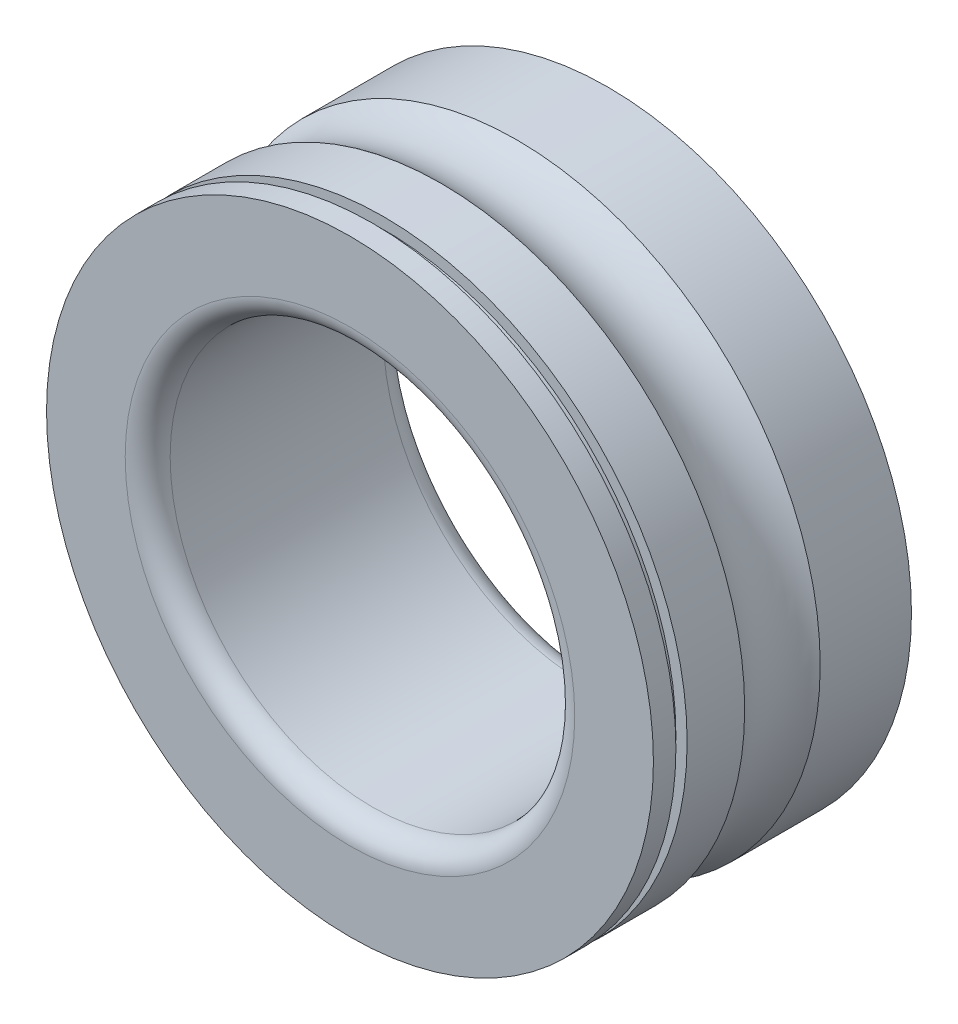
ISO-10303-21;
HEADER;
FILE_DESCRIPTION(('STEP AP214'),'2;1');
FILE_NAME('part.step','',(''),(''),'','','');
FILE_SCHEMA(('AUTOMOTIVE_DESIGN { 1 0 10303 214 1 1 1 1 }'));
ENDSEC;
DATA;
#1=APPLICATION_CONTEXT('core data for automotive mechanical design processes');
#2=APPLICATION_PROTOCOL_DEFINITION('international standard','automotive_design',2000,#1);
#3=PRODUCT_CONTEXT('',#1,'mechanical');
#4=PRODUCT('Part','Part','',(#3));
#5=PRODUCT_RELATED_PRODUCT_CATEGORY('part','',(#4));
#6=PRODUCT_DEFINITION_FORMATION('','',#4);
#7=PRODUCT_DEFINITION_CONTEXT('part definition',#1,'design');
#8=PRODUCT_DEFINITION('design','',#6,#7);
#9=PRODUCT_DEFINITION_SHAPE('','',#8);
#10=(LENGTH_UNIT() NAMED_UNIT(*) SI_UNIT(.MILLI.,.METRE.));
#11=(NAMED_UNIT(*) PLANE_ANGLE_UNIT() SI_UNIT($,.RADIAN.));
#12=(NAMED_UNIT(*) SI_UNIT($,.STERADIAN.) SOLID_ANGLE_UNIT());
#13=UNCERTAINTY_MEASURE_WITH_UNIT(LENGTH_MEASURE(1.E-05),#10,'distance_accuracy_value','');
#14=(GEOMETRIC_REPRESENTATION_CONTEXT(3) GLOBAL_UNCERTAINTY_ASSIGNED_CONTEXT((#13)) GLOBAL_UNIT_ASSIGNED_CONTEXT((#10,
#11,#12)) REPRESENTATION_CONTEXT('',''));
#15=CARTESIAN_POINT('',(0.,0.,0.));
#16=DIRECTION('',(0.,0.,1.));
#17=DIRECTION('',(1.,0.,0.));
#18=AXIS2_PLACEMENT_3D('',#15,#16,#17);
#19=CARTESIAN_POINT('',(0.,0.,-2.37));
#20=DIRECTION('',(0.,0.,-1.));
#21=DIRECTION('',(-1.,0.,0.));
#22=AXIS2_PLACEMENT_3D('',#19,#20,#21);
#23=TOROIDAL_SURFACE('',#22,5.,0.5);
#24=CARTESIAN_POINT('',(0.,0.,-2.37));
#25=DIRECTION('',(0.,0.,-1.));
#26=DIRECTION('',(-1.,0.,0.));
#27=AXIS2_PLACEMENT_3D('',#24,#25,#26);
#28=CIRCLE('',#27,4.5);
#29=CARTESIAN_POINT('',(-4.5,0.,-2.37));
#30=VERTEX_POINT('',#29);
#31=EDGE_CURVE('E10',#30,#30,#28,.T.);
#32=ORIENTED_EDGE('',*,*,#31,.F.);
#33=EDGE_LOOP('',(#32));
#34=FACE_BOUND('',#33,.T.);
#35=CARTESIAN_POINT('',(0.,0.,-2.87));
#36=DIRECTION('',(0.,0.,-1.));
#37=DIRECTION('',(-1.,0.,0.));
#38=AXIS2_PLACEMENT_3D('',#35,#36,#37);
#39=CIRCLE('',#38,5.);
#40=CARTESIAN_POINT('',(-5.,0.,-2.87));
#41=VERTEX_POINT('',#40);
#42=EDGE_CURVE('E70',#41,#41,#39,.T.);
#43=ORIENTED_EDGE('',*,*,#42,.T.);
#44=EDGE_LOOP('',(#43));
#45=FACE_BOUND('',#44,.T.);
#46=ADVANCED_FACE('F30',(#34,#45),#23,.T.);
#47=CARTESIAN_POINT('',(0.,0.,0.));
#48=DIRECTION('',(0.,0.,-1.));
#49=DIRECTION('',(-1.,0.,0.));
#50=AXIS2_PLACEMENT_3D('',#47,#48,#49);
#51=CYLINDRICAL_SURFACE('',#50,4.5);
#52=CARTESIAN_POINT('',(0.,0.,2.37));
#53=DIRECTION('',(0.,0.,-1.));
#54=DIRECTION('',(-1.,0.,0.));
#55=AXIS2_PLACEMENT_3D('',#52,#53,#54);
#56=CIRCLE('',#55,4.5);
#57=CARTESIAN_POINT('',(-4.5,0.,2.37));
#58=VERTEX_POINT('',#57);
#59=EDGE_CURVE('E36',#58,#58,#56,.T.);
#60=ORIENTED_EDGE('',*,*,#59,.F.);
#61=EDGE_LOOP('',(#60));
#62=FACE_BOUND('',#61,.T.);
#63=ORIENTED_EDGE('',*,*,#31,.T.);
#64=EDGE_LOOP('',(#63));
#65=FACE_BOUND('',#64,.T.);
#66=ADVANCED_FACE('F87',(#62,#65),#51,.F.);
#67=CARTESIAN_POINT('',(0.,0.,2.37));
#68=DIRECTION('',(0.,0.,-1.));
#69=DIRECTION('',(-1.,0.,0.));
#70=AXIS2_PLACEMENT_3D('',#67,#68,#69);
#71=TOROIDAL_SURFACE('',#70,5.,0.499999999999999);
#72=ORIENTED_EDGE('',*,*,#59,.T.);
#73=EDGE_LOOP('',(#72));
#74=FACE_BOUND('',#73,.T.);
#75=CARTESIAN_POINT('',(0.,0.,2.87));
#76=DIRECTION('',(0.,0.,-1.));
#77=DIRECTION('',(-1.,0.,0.));
#78=AXIS2_PLACEMENT_3D('',#75,#76,#77);
#79=CIRCLE('',#78,5.);
#80=CARTESIAN_POINT('',(-5.,0.,2.87));
#81=VERTEX_POINT('',#80);
#82=EDGE_CURVE('E40',#81,#81,#79,.T.);
#83=ORIENTED_EDGE('',*,*,#82,.F.);
#84=EDGE_LOOP('',(#83));
#85=FACE_BOUND('',#84,.T.);
#86=ADVANCED_FACE('F92',(#74,#85),#71,.T.);
#87=CARTESIAN_POINT('',(0.,6.75,2.87));
#88=DIRECTION('',(0.,0.,1.));
#89=DIRECTION('',(1.,0.,0.));
#90=AXIS2_PLACEMENT_3D('',#87,#88,#89);
#91=PLANE('',#90);
#92=ORIENTED_EDGE('',*,*,#82,.T.);
#93=EDGE_LOOP('',(#92));
#94=FACE_BOUND('',#93,.T.);
#95=CARTESIAN_POINT('',(0.,0.,2.87));
#96=DIRECTION('',(0.,0.,-1.));
#97=DIRECTION('',(-1.,0.,0.));
#98=AXIS2_PLACEMENT_3D('',#95,#96,#97);
#99=CIRCLE('',#98,6.75);
#100=CARTESIAN_POINT('',(-6.75,0.,2.87));
#101=VERTEX_POINT('',#100);
#102=EDGE_CURVE('E44',#101,#101,#99,.T.);
#103=ORIENTED_EDGE('',*,*,#102,.F.);
#104=EDGE_LOOP('',(#103));
#105=FACE_BOUND('',#104,.T.);
#106=ADVANCED_FACE('F97',(#94,#105),#91,.T.);
#107=CARTESIAN_POINT('',(0.,0.,0.));
#108=DIRECTION('',(0.,0.,-1.));
#109=DIRECTION('',(-1.,0.,0.));
#110=AXIS2_PLACEMENT_3D('',#107,#108,#109);
#111=CYLINDRICAL_SURFACE('',#110,6.75);
#112=CARTESIAN_POINT('',(0.,0.,2.37));
#113=DIRECTION('',(0.,0.,-1.));
#114=DIRECTION('',(-1.,0.,0.));
#115=AXIS2_PLACEMENT_3D('',#112,#113,#114);
#116=CIRCLE('',#115,6.75);
#117=CARTESIAN_POINT('',(-6.75,0.,2.37));
#118=VERTEX_POINT('',#117);
#119=EDGE_CURVE('E49',#118,#118,#116,.T.);
#120=ORIENTED_EDGE('',*,*,#119,.F.);
#121=EDGE_LOOP('',(#120));
#122=FACE_BOUND('',#121,.T.);
#123=ORIENTED_EDGE('',*,*,#102,.T.);
#124=EDGE_LOOP('',(#123));
#125=FACE_BOUND('',#124,.T.);
#126=ADVANCED_FACE('F102',(#122,#125),#111,.T.);
#127=CARTESIAN_POINT('',(0.,6.75,2.37));
#128=DIRECTION('',(0.,0.,1.));
#129=DIRECTION('',(1.,0.,0.));
#130=AXIS2_PLACEMENT_3D('',#127,#128,#129);
#131=PLANE('',#130);
#132=CARTESIAN_POINT('',(0.,0.,2.37));
#133=DIRECTION('',(0.,0.,-1.));
#134=DIRECTION('',(-1.,0.,0.));
#135=AXIS2_PLACEMENT_3D('',#132,#133,#134);
#136=CIRCLE('',#135,6.5);
#137=CARTESIAN_POINT('',(-6.5,0.,2.37));
#138=VERTEX_POINT('',#137);
#139=EDGE_CURVE('E52',#138,#138,#136,.T.);
#140=ORIENTED_EDGE('',*,*,#139,.F.);
#141=EDGE_LOOP('',(#140));
#142=FACE_BOUND('',#141,.T.);
#143=ORIENTED_EDGE('',*,*,#119,.T.);
#144=EDGE_LOOP('',(#143));
#145=FACE_BOUND('',#144,.T.);
#146=ADVANCED_FACE('F106',(#142,#145),#131,.F.);
#147=CARTESIAN_POINT('',(0.,0.,0.));
#148=DIRECTION('',(0.,0.,-1.));
#149=DIRECTION('',(-1.,0.,0.));
#150=AXIS2_PLACEMENT_3D('',#147,#148,#149);
#151=CYLINDRICAL_SURFACE('',#150,6.5);
#152=CARTESIAN_POINT('',(0.,0.,2.12));
#153=DIRECTION('',(0.,0.,-1.));
#154=DIRECTION('',(-1.,0.,0.));
#155=AXIS2_PLACEMENT_3D('',#152,#153,#154);
#156=CIRCLE('',#155,6.5);
#157=CARTESIAN_POINT('',(-6.5,0.,2.12));
#158=VERTEX_POINT('',#157);
#159=EDGE_CURVE('E55',#158,#158,#156,.T.);
#160=ORIENTED_EDGE('',*,*,#159,.F.);
#161=EDGE_LOOP('',(#160));
#162=FACE_BOUND('',#161,.T.);
#163=ORIENTED_EDGE('',*,*,#139,.T.);
#164=EDGE_LOOP('',(#163));
#165=FACE_BOUND('',#164,.T.);
#166=ADVANCED_FACE('F110',(#162,#165),#151,.T.);
#167=CARTESIAN_POINT('',(0.,6.5,2.12));
#168=DIRECTION('',(0.,0.,-1.));
#169=DIRECTION('',(-1.,0.,0.));
#170=AXIS2_PLACEMENT_3D('',#167,#168,#169);
#171=PLANE('',#170);
#172=CARTESIAN_POINT('',(0.,0.,2.12));
#173=DIRECTION('',(0.,0.,-1.));
#174=DIRECTION('',(-1.,0.,0.));
#175=AXIS2_PLACEMENT_3D('',#172,#173,#174);
#176=CIRCLE('',#175,6.75);
#177=CARTESIAN_POINT('',(-6.75,0.,2.12));
#178=VERTEX_POINT('',#177);
#179=EDGE_CURVE('E58',#178,#178,#176,.T.);
#180=ORIENTED_EDGE('',*,*,#179,.F.);
#181=EDGE_LOOP('',(#180));
#182=FACE_BOUND('',#181,.T.);
#183=ORIENTED_EDGE('',*,*,#159,.T.);
#184=EDGE_LOOP('',(#183));
#185=FACE_BOUND('',#184,.T.);
#186=ADVANCED_FACE('F114',(#182,#185),#171,.F.);
#187=CARTESIAN_POINT('',(0.,0.,0.));
#188=DIRECTION('',(0.,0.,-1.));
#189=DIRECTION('',(-1.,0.,0.));
#190=AXIS2_PLACEMENT_3D('',#187,#188,#189);
#191=CYLINDRICAL_SURFACE('',#190,6.75);
#192=CARTESIAN_POINT('',(0.,0.,0.839999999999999));
#193=DIRECTION('',(0.,0.,-1.));
#194=DIRECTION('',(-1.,0.,0.));
#195=AXIS2_PLACEMENT_3D('',#192,#193,#194);
#196=CIRCLE('',#195,6.75);
#197=CARTESIAN_POINT('',(-6.75,0.,0.839999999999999));
#198=VERTEX_POINT('',#197);
#199=EDGE_CURVE('E61',#198,#198,#196,.T.);
#200=ORIENTED_EDGE('',*,*,#199,.F.);
#201=EDGE_LOOP('',(#200));
#202=FACE_BOUND('',#201,.T.);
#203=ORIENTED_EDGE('',*,*,#179,.T.);
#204=EDGE_LOOP('',(#203));
#205=FACE_BOUND('',#204,.T.);
#206=ADVANCED_FACE('F118',(#202,#205),#191,.T.);
#207=CARTESIAN_POINT('',(0.,0.,0.));
#208=DIRECTION('',(0.,0.,-1.));
#209=DIRECTION('',(-1.,0.,0.));
#210=AXIS2_PLACEMENT_3D('',#207,#208,#209);
#211=TOROIDAL_SURFACE('',#210,7.87,1.4);
#212=CARTESIAN_POINT('',(0.,0.,-0.839999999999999));
#213=DIRECTION('',(0.,0.,-1.));
#214=DIRECTION('',(-1.,0.,0.));
#215=AXIS2_PLACEMENT_3D('',#212,#213,#214);
#216=CIRCLE('',#215,6.75);
#217=CARTESIAN_POINT('',(-6.75,0.,-0.839999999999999));
#218=VERTEX_POINT('',#217);
#219=EDGE_CURVE('E64',#218,#218,#216,.T.);
#220=ORIENTED_EDGE('',*,*,#219,.F.);
#221=EDGE_LOOP('',(#220));
#222=FACE_BOUND('',#221,.T.);
#223=ORIENTED_EDGE('',*,*,#199,.T.);
#224=EDGE_LOOP('',(#223));
#225=FACE_BOUND('',#224,.T.);
#226=ADVANCED_FACE('F83',(#222,#225),#211,.F.);
#227=CARTESIAN_POINT('',(0.,0.,0.));
#228=DIRECTION('',(0.,0.,-1.));
#229=DIRECTION('',(-1.,0.,0.));
#230=AXIS2_PLACEMENT_3D('',#227,#228,#229);
#231=CYLINDRICAL_SURFACE('',#230,6.75);
#232=CARTESIAN_POINT('',(0.,0.,-2.87));
#233=DIRECTION('',(0.,0.,-1.));
#234=DIRECTION('',(-1.,0.,0.));
#235=AXIS2_PLACEMENT_3D('',#232,#233,#234);
#236=CIRCLE('',#235,6.75);
#237=CARTESIAN_POINT('',(-6.75,0.,-2.87));
#238=VERTEX_POINT('',#237);
#239=EDGE_CURVE('E67',#238,#238,#236,.T.);
#240=ORIENTED_EDGE('',*,*,#239,.F.);
#241=EDGE_LOOP('',(#240));
#242=FACE_BOUND('',#241,.T.);
#243=ORIENTED_EDGE('',*,*,#219,.T.);
#244=EDGE_LOOP('',(#243));
#245=FACE_BOUND('',#244,.T.);
#246=ADVANCED_FACE('F77',(#242,#245),#231,.T.);
#247=CARTESIAN_POINT('',(0.,5.,-2.87));
#248=DIRECTION('',(0.,0.,-1.));
#249=DIRECTION('',(-1.,0.,0.));
#250=AXIS2_PLACEMENT_3D('',#247,#248,#249);
#251=PLANE('',#250);
#252=ORIENTED_EDGE('',*,*,#239,.T.);
#253=EDGE_LOOP('',(#252));
#254=FACE_BOUND('',#253,.T.);
#255=ORIENTED_EDGE('',*,*,#42,.F.);
#256=EDGE_LOOP('',(#255));
#257=FACE_BOUND('',#256,.T.);
#258=ADVANCED_FACE('F75',(#254,#257),#251,.T.);
#259=CLOSED_SHELL('',(#46,#66,#86,#106,#126,#146,#166,#186,#206,#226,#246,#258));
#260=MANIFOLD_SOLID_BREP('B2',#259);
#261=ADVANCED_BREP_SHAPE_REPRESENTATION('',(#18,#260),#14);
#262=SHAPE_DEFINITION_REPRESENTATION(#9,#261);
ENDSEC;
END-ISO-10303-21;
